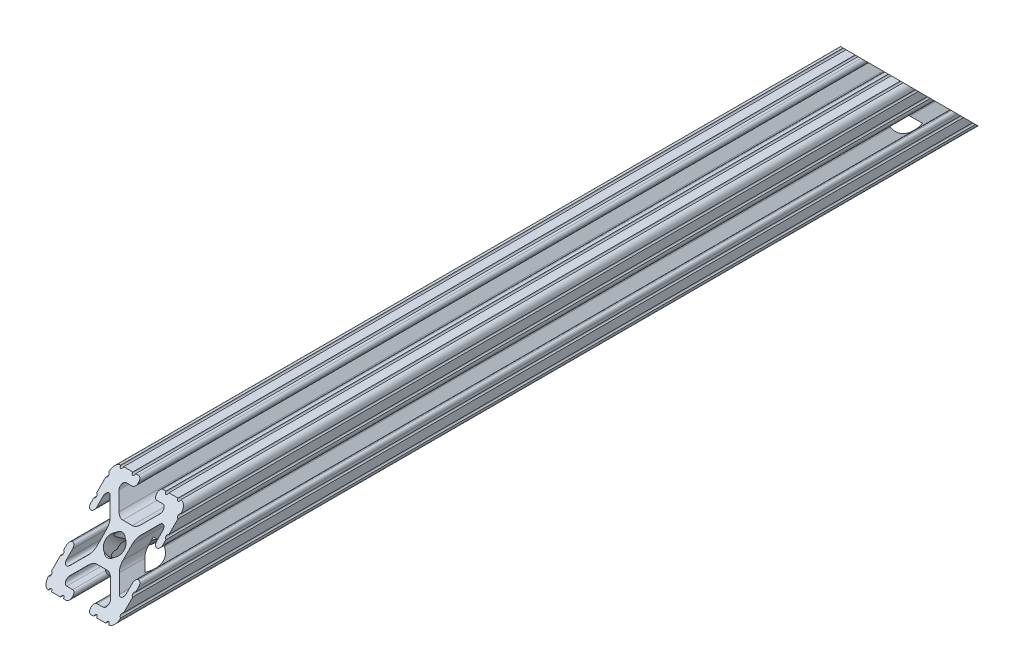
from build123d import *

# Parameters (mm, degrees)
BOSS_EXTRUDE1_DEPTH      = 152.4
BOSS_EXTRUDE1_DEPTH_BACK = 152.4
SKETCH1_R                = 2.6035
CUT_EXTRUDE1_DEPTH       = 12.7
CUT_EXTRUDE1_DEPTH_BACK  = 12.7


with BuildPart() as part:
    # Sketch1 → Boss-Extrude1 (new, two sides: drawn at the far end of the back side and taken through both)
    with BuildSketch(Plane.XY.offset(-BOSS_EXTRUDE1_DEPTH_BACK)):
        with BuildLine():
            Line((-12.7, 9.5504), (-12.7, 6.3331344))
            ThreePointArc((-12.7, 6.3331344), (-12.192, 5.8251344), (-12.7, 5.3171344))
            Line((-12.7, 5.3171344), (-12.7, 4.287470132))
            ThreePointArc((-12.7, 4.287470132), (-12.392749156, 3.545700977), (-11.65098, 3.238450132))
            Line((-11.65098, 3.238450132), (-11.53922, 3.238450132))
            ThreePointArc((-11.53922, 3.238450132), (-10.797450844, 3.545700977), (-10.4902, 4.287470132))
            Line((-10.4902, 4.287470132), (-10.4902, 6.402089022))
            ThreePointArc((-10.4902, 6.402089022), (-9.856394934, 7.351113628), (-8.736962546, 7.129240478))
            Line((-8.736962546, 7.129240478), (-5.440484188, 3.838768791))
            ThreePointArc((-5.440484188, 3.838768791), (-4.750736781, 2.808015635), (-4.5085, 1.591658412))
            Line((-4.5085, 1.591658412), (-4.5085, -1.591658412))
            ThreePointArc((-4.5085, -1.591658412), (-4.75073678, -2.808015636), (-5.440484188, -3.838768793))
            Line((-5.440484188, -3.838768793), (-8.736962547, -7.12924048))
            ThreePointArc((-8.736962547, -7.12924048), (-9.856394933, -7.351113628), (-10.4902, -6.402089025))
            Line((-10.4902, -6.402089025), (-10.4902, -4.287470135))
            ThreePointArc((-10.4902, -4.287470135), (-10.797450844, -3.545700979), (-11.53922, -3.238450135))
            Line((-11.53922, -3.238450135), (-11.65098, -3.238450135))
            ThreePointArc((-11.65098, -3.238450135), (-12.392749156, -3.545700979), (-12.7, -4.287470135))
            Line((-12.7, -4.287470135), (-12.7, -5.3170836))
            ThreePointArc((-12.7, -5.3170836), (-12.192, -5.8250836), (-12.7, -6.3330836))
            Line((-12.7, -6.3330836), (-12.7, -9.5504))
            ThreePointArc((-12.7, -9.5504), (-12.192000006, -10.058323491), (-12.699846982, -10.566399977))
            ThreePointArc((-12.699846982, -10.566399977), (-12.082522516, -12.082522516), (-10.566399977, -12.699846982))
            ThreePointArc((-10.566399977, -12.699846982), (-10.058323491, -12.192000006), (-9.5504, -12.7))
            Line((-9.5504, -12.7), (-6.3331344, -12.7))
            ThreePointArc((-6.3331344, -12.7), (-5.8251344, -12.192), (-5.3171344, -12.7))
            Line((-5.3171344, -12.7), (-4.28752, -12.7))
            ThreePointArc((-4.28752, -12.7), (-3.545750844, -12.392749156), (-3.2385, -11.65098))
            Line((-3.2385, -11.65098), (-3.2385, -11.53922))
            ThreePointArc((-3.2385, -11.53922), (-3.545750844, -10.797450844), (-4.28752, -10.4902))
            Line((-4.28752, -10.4902), (-6.41641086, -10.4902))
            ThreePointArc((-6.41641086, -10.4902), (-7.414733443, -9.822812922), (-7.17965273, -8.645192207))
            Line((-7.17965273, -8.645192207), (-3.95226937, -5.42368962))
            ThreePointArc((-3.95226937, -5.42368962), (-2.922935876, -4.736928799), (-1.709253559, -4.4958))
            Line((-1.709253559, -4.4958), (1.709253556, -4.4958))
            ThreePointArc((1.709253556, -4.4958), (2.922935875, -4.736928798), (3.952269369, -5.423689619))
            Line((3.952269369, -5.423689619), (7.179652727, -8.645192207))
            ThreePointArc((7.179652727, -8.645192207), (7.414733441, -9.822812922), (6.416410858, -10.4902))
            Line((6.416410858, -10.4902), (4.28752, -10.4902))
            ThreePointArc((4.28752, -10.4902), (3.545750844, -10.797450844), (3.2385, -11.53922))
            Line((3.2385, -11.53922), (3.2385, -11.65098))
            ThreePointArc((3.2385, -11.65098), (3.545750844, -12.392749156), (4.28752, -12.7))
            Line((4.28752, -12.7), (5.3171344, -12.7))
            ThreePointArc((5.3171344, -12.7), (5.8251344, -12.192), (6.3331344, -12.7))
            Line((6.3331344, -12.7), (9.5504, -12.7))
            ThreePointArc((9.5504, -12.7), (10.058323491, -12.192000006), (10.566399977, -12.699846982))
            ThreePointArc((10.566399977, -12.699846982), (12.082522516, -12.082522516), (12.699846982, -10.566399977))
            ThreePointArc((12.699846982, -10.566399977), (12.192000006, -10.058323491), (12.7, -9.5504))
            Line((12.7, -9.5504), (12.7, -6.3330836))
            ThreePointArc((12.7, -6.3330836), (12.192, -5.8250836), (12.7, -5.3170836))
            Line((12.7, -5.3170836), (12.7, -4.287470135))
            ThreePointArc((12.7, -4.287470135), (12.392749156, -3.545700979), (11.65098, -3.238450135))
            Line((11.65098, -3.238450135), (11.53922, -3.238450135))
            ThreePointArc((11.53922, -3.238450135), (10.797450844, -3.545700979), (10.4902, -4.287470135))
            Line((10.4902, -4.287470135), (10.4902, -6.402089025))
            ThreePointArc((10.4902, -6.402089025), (9.856394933, -7.351113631), (8.736962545, -7.12924048))
            Line((8.736962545, -7.12924048), (5.440484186, -3.838768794))
            ThreePointArc((5.440484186, -3.838768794), (4.75073678, -2.808015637), (4.5085, -1.591658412))
            Line((4.5085, -1.591658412), (4.5085, 1.591658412))
            ThreePointArc((4.5085, 1.591658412), (4.75073678, 2.808015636), (5.440484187, 3.838768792))
            Line((5.440484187, 3.838768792), (8.736962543, 7.129240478))
            ThreePointArc((8.736962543, 7.129240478), (9.856394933, 7.351113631), (10.4902, 6.402089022))
            Line((10.4902, 6.402089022), (10.4902, 4.287470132))
            ThreePointArc((10.4902, 4.287470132), (10.797450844, 3.545700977), (11.53922, 3.238450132))
            Line((11.53922, 3.238450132), (11.65098, 3.238450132))
            ThreePointArc((11.65098, 3.238450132), (12.392749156, 3.545700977), (12.7, 4.287470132))
            Line((12.7, 4.287470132), (12.7, 5.3171344))
            ThreePointArc((12.7, 5.3171344), (12.192, 5.8251344), (12.7, 6.3331344))
            Line((12.7, 6.3331344), (12.7, 9.5504))
            ThreePointArc((12.7, 9.5504), (12.192000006, 10.058323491), (12.699846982, 10.566399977))
            ThreePointArc((12.699846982, 10.566399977), (12.082522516, 12.082522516), (10.566399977, 12.699846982))
            ThreePointArc((10.566399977, 12.699846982), (10.058323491, 12.192000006), (9.5504, 12.7))
            Line((9.5504, 12.7), (6.3330836, 12.7))
            ThreePointArc((6.3330836, 12.7), (5.8250836, 12.192), (5.3170836, 12.7))
            Line((5.3170836, 12.7), (4.2874692, 12.7))
            ThreePointArc((4.2874692, 12.7), (3.545700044, 12.392749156), (3.2384492, 11.65098))
            Line((3.2384492, 11.65098), (3.2384492, 11.53922))
            ThreePointArc((3.2384492, 11.53922), (3.545700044, 10.797450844), (4.2874692, 10.4902))
            Line((4.2874692, 10.4902), (6.476774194, 10.4902))
            ThreePointArc((6.476774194, 10.4902), (7.432162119, 9.851515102), (7.207191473, 8.724540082))
            Line((7.207191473, 8.724540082), (3.900315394, 5.42368962))
            ThreePointArc((3.900315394, 5.42368962), (2.8709819, 4.736928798), (1.657299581, 4.4958))
            Line((1.657299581, 4.4958), (-1.657299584, 4.4958))
            ThreePointArc((-1.657299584, 4.4958), (-2.870981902, 4.736928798), (-3.900315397, 5.42368962))
            Line((-3.900315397, 5.42368962), (-7.207191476, 8.724540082))
            ThreePointArc((-7.207191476, 8.724540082), (-7.432162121, 9.851515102), (-6.476774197, 10.4902))
            Line((-6.476774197, 10.4902), (-4.2874692, 10.4902))
            ThreePointArc((-4.2874692, 10.4902), (-3.545700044, 10.797450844), (-3.2384492, 11.53922))
            Line((-3.2384492, 11.53922), (-3.2384492, 11.65098))
            ThreePointArc((-3.2384492, 11.65098), (-3.545700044, 12.392749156), (-4.2874692, 12.7))
            Line((-4.2874692, 12.7), (-5.3170836, 12.7))
            ThreePointArc((-5.3170836, 12.7), (-5.8250836, 12.192), (-6.3330836, 12.7))
            Line((-6.3330836, 12.7), (-9.5504, 12.7))
            ThreePointArc((-9.5504, 12.7), (-10.058323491, 12.192000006), (-10.566399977, 12.699846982))
            ThreePointArc((-10.566399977, 12.699846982), (-12.082522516, 12.082522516), (-12.699846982, 10.566399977))
            ThreePointArc((-12.699846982, 10.566399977), (-12.192000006, 10.058323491), (-12.7, 9.5504))
        make_face()
        with Locations(Location((0, 0, 0), (0, 0, 180))):
            Circle(SKETCH1_R, mode=Mode.SUBTRACT)
    extrude(amount=BOSS_EXTRUDE1_DEPTH + BOSS_EXTRUDE1_DEPTH_BACK)

    # Sketch2 → Cut-Extrude1 (cut, two sides: drawn at the far end of the back side and taken through both)
    with BuildSketch(Plane(origin=(0, 0, 0), x_dir=(0, 0, -1), z_dir=(1, 0, 0)).offset(-CUT_EXTRUDE1_DEPTH_BACK)):
        Polygon((-165.1, 23.85473095), (-165.1, -25.4), (-127, 12.7), (127, 12.7), (165.1, -25.4), (165.1, 23.85473095), align=None)
    extrude(amount=CUT_EXTRUDE1_DEPTH + CUT_EXTRUDE1_DEPTH_BACK, mode=Mode.SUBTRACT)

    # Sketch3 → Cut-Revolve1 (revolve, cut)
    with BuildSketch(Plane(origin=(0, 0, 0), x_dir=(0, 0, -1), z_dir=(1, 0, 0))):
        Polygon((-139.7, 0), (-137.392074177, 2.307925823), (-132.901946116, -2.182202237), (-129.597211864, 1.122532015), (-115.774679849, -12.7), (-121.387339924, -18.312660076), align=None)
    revolve(axis=Axis((0, -18.312660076, 121.387339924), (0, 0.7071067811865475, 0.7071067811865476)), mode=Mode.SUBTRACT)

    # Sketch4 → Cut-Revolve2 (revolve, cut)
    with BuildSketch(Plane(origin=(0, 0, 0), x_dir=(0, 0, -1), z_dir=(1, 0, 0))):
        Polygon((121.387339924, -18.312660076), (115.774679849, -12.7), (129.597211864, 1.122532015), (132.901946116, -2.182202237), (137.392074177, 2.307925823), (139.7, 0), align=None)
    revolve(axis=Axis((0, 0, -139.7), (0, -0.7071067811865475, 0.7071067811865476)), mode=Mode.SUBTRACT)


solid = part.part
